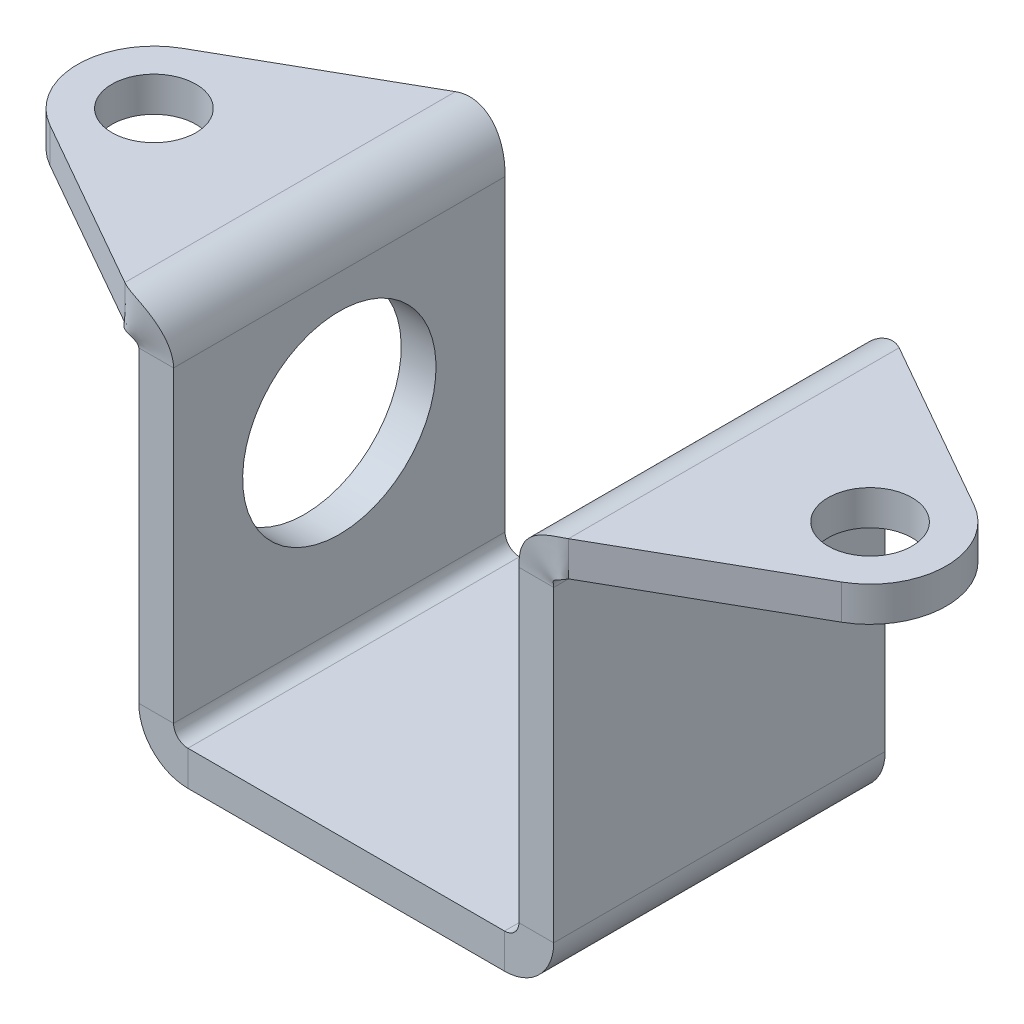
ISO-10303-21;
HEADER;
FILE_DESCRIPTION(('STEP AP214'),'2;1');
FILE_NAME('part.step','',(''),(''),'','','');
FILE_SCHEMA(('AUTOMOTIVE_DESIGN { 1 0 10303 214 1 1 1 1 }'));
ENDSEC;
DATA;
#1=APPLICATION_CONTEXT('core data for automotive mechanical design processes');
#2=APPLICATION_PROTOCOL_DEFINITION('international standard','automotive_design',2000,#1);
#3=PRODUCT_CONTEXT('',#1,'mechanical');
#4=PRODUCT('Part','Part','',(#3));
#5=PRODUCT_RELATED_PRODUCT_CATEGORY('part','',(#4));
#6=PRODUCT_DEFINITION_FORMATION('','',#4);
#7=PRODUCT_DEFINITION_CONTEXT('part definition',#1,'design');
#8=PRODUCT_DEFINITION('design','',#6,#7);
#9=PRODUCT_DEFINITION_SHAPE('','',#8);
#10=(LENGTH_UNIT() NAMED_UNIT(*) SI_UNIT(.MILLI.,.METRE.));
#11=(NAMED_UNIT(*) PLANE_ANGLE_UNIT() SI_UNIT($,.RADIAN.));
#12=(NAMED_UNIT(*) SI_UNIT($,.STERADIAN.) SOLID_ANGLE_UNIT());
#13=UNCERTAINTY_MEASURE_WITH_UNIT(LENGTH_MEASURE(1.E-05),#10,'distance_accuracy_value','');
#14=(GEOMETRIC_REPRESENTATION_CONTEXT(3) GLOBAL_UNCERTAINTY_ASSIGNED_CONTEXT((#13)) GLOBAL_UNIT_ASSIGNED_CONTEXT((#10,
#11,#12)) REPRESENTATION_CONTEXT('',''));
#15=CARTESIAN_POINT('',(0.,0.,0.));
#16=DIRECTION('',(0.,0.,1.));
#17=DIRECTION('',(1.,0.,0.));
#18=AXIS2_PLACEMENT_3D('',#15,#16,#17);
#19=CARTESIAN_POINT('',(-9.92100328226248,-32.4177103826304,9.525));
#20=DIRECTION('',(0.,0.,1.));
#21=DIRECTION('',(0.,1.,0.));
#22=AXIS2_PLACEMENT_3D('',#19,#20,#21);
#23=PLANE('',#22);
#24=CARTESIAN_POINT('',(-11.9210032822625,-35.2427105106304,9.525));
#25=CARTESIAN_POINT('',(-9.92100328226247,-35.2427105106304,9.525));
#26=B_SPLINE_CURVE_WITH_KNOTS('',1,(#24,#25),.UNSPECIFIED.,.F.,.F.,(2,2),(0.,1.),.UNSPECIFIED.);
#27=CARTESIAN_POINT('',(-11.9210032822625,-35.2427105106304,9.525));
#28=VERTEX_POINT('',#27);
#29=CARTESIAN_POINT('',(-9.92100328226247,-35.2427105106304,9.525));
#30=VERTEX_POINT('',#29);
#31=EDGE_CURVE('E13',#28,#30,#26,.T.);
#32=ORIENTED_EDGE('',*,*,#31,.F.);
#33=DIRECTION('',(0.,-1.,0.));
#34=VECTOR('',#33,1.);
#35=CARTESIAN_POINT('',(-11.9210032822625,-32.4177103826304,9.525));
#36=LINE('',#35,#34);
#37=CARTESIAN_POINT('',(-11.9210032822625,-52.9287102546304,9.525));
#38=VERTEX_POINT('',#37);
#39=EDGE_CURVE('E140',#38,#28,#36,.F.);
#40=ORIENTED_EDGE('',*,*,#39,.F.);
#41=DIRECTION('',(1.,0.,0.));
#42=VECTOR('',#41,1.);
#43=CARTESIAN_POINT('',(-9.92100328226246,-52.9287102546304,9.525));
#44=LINE('',#43,#42);
#45=CARTESIAN_POINT('',(-9.92100328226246,-52.9287102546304,9.525));
#46=VERTEX_POINT('',#45);
#47=EDGE_CURVE('E63',#38,#46,#44,.T.);
#48=ORIENTED_EDGE('',*,*,#47,.T.);
#49=DIRECTION('',(0.,1.,0.));
#50=VECTOR('',#49,1.);
#51=CARTESIAN_POINT('',(-9.92100328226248,-32.4177103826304,9.525));
#52=LINE('',#51,#50);
#53=EDGE_CURVE('E142',#46,#30,#52,.T.);
#54=ORIENTED_EDGE('',*,*,#53,.T.);
#55=EDGE_LOOP('',(#32,#40,#48,#54));
#56=FACE_BOUND('',#55,.T.);
#57=ADVANCED_FACE('F51',(#56),#23,.T.);
#58=CARTESIAN_POINT('',(-9.09600315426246,-52.9287102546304,9.525));
#59=DIRECTION('',(0.,0.,1.));
#60=DIRECTION('',(1.,0.,0.));
#61=AXIS2_PLACEMENT_3D('',#58,#59,#60);
#62=PLANE('',#61);
#63=ORIENTED_EDGE('',*,*,#47,.F.);
#64=CARTESIAN_POINT('',(-9.09600315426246,-52.9287102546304,9.525));
#65=DIRECTION('',(0.,0.,1.));
#66=DIRECTION('',(1.,0.,0.));
#67=AXIS2_PLACEMENT_3D('',#64,#65,#66);
#68=CIRCLE('',#67,2.825000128);
#69=CARTESIAN_POINT('',(-9.09600315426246,-55.7537103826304,9.525));
#70=VERTEX_POINT('',#69);
#71=EDGE_CURVE('E610',#38,#70,#68,.T.);
#72=ORIENTED_EDGE('',*,*,#71,.T.);
#73=DIRECTION('',(0.,1.,0.));
#74=VECTOR('',#73,1.);
#75=CARTESIAN_POINT('',(-9.09600315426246,-53.7537103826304,9.525));
#76=LINE('',#75,#74);
#77=CARTESIAN_POINT('',(-9.09600315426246,-53.7537103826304,9.525));
#78=VERTEX_POINT('',#77);
#79=EDGE_CURVE('E227',#70,#78,#76,.T.);
#80=ORIENTED_EDGE('',*,*,#79,.T.);
#81=CARTESIAN_POINT('',(-9.09600315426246,-52.9287102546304,9.525));
#82=DIRECTION('',(0.,0.,-1.));
#83=DIRECTION('',(-1.,0.,0.));
#84=AXIS2_PLACEMENT_3D('',#81,#82,#83);
#85=CIRCLE('',#84,0.825000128);
#86=EDGE_CURVE('E578',#46,#78,#85,.F.);
#87=ORIENTED_EDGE('',*,*,#86,.F.);
#88=EDGE_LOOP('',(#63,#72,#80,#87));
#89=FACE_BOUND('',#88,.T.);
#90=ADVANCED_FACE('F846',(#89),#62,.T.);
#91=CARTESIAN_POINT('',(-9.92100328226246,-53.7537103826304,9.525));
#92=DIRECTION('',(0.,0.,1.));
#93=DIRECTION('',(-1.,0.,0.));
#94=AXIS2_PLACEMENT_3D('',#91,#92,#93);
#95=PLANE('',#94);
#96=ORIENTED_EDGE('',*,*,#79,.F.);
#97=DIRECTION('',(1.,0.,0.));
#98=VECTOR('',#97,1.);
#99=CARTESIAN_POINT('',(-9.92100328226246,-55.7537103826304,9.525));
#100=LINE('',#99,#98);
#101=CARTESIAN_POINT('',(9.09600315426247,-55.7537103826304,9.525));
#102=VERTEX_POINT('',#101);
#103=EDGE_CURVE('E614',#102,#70,#100,.F.);
#104=ORIENTED_EDGE('',*,*,#103,.F.);
#105=DIRECTION('',(0.,1.,0.));
#106=VECTOR('',#105,1.);
#107=CARTESIAN_POINT('',(9.09600315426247,-53.7537103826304,9.525));
#108=LINE('',#107,#106);
#109=CARTESIAN_POINT('',(9.09600315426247,-53.7537103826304,9.525));
#110=VERTEX_POINT('',#109);
#111=EDGE_CURVE('E230',#102,#110,#108,.T.);
#112=ORIENTED_EDGE('',*,*,#111,.T.);
#113=DIRECTION('',(-1.,0.,0.));
#114=VECTOR('',#113,1.);
#115=CARTESIAN_POINT('',(-9.92100328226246,-53.7537103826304,9.525));
#116=LINE('',#115,#114);
#117=EDGE_CURVE('E877',#110,#78,#116,.T.);
#118=ORIENTED_EDGE('',*,*,#117,.T.);
#119=EDGE_LOOP('',(#96,#104,#112,#118));
#120=FACE_BOUND('',#119,.T.);
#121=ADVANCED_FACE('F850',(#120),#95,.T.);
#122=CARTESIAN_POINT('',(9.09600315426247,-52.9287102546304,9.525));
#123=DIRECTION('',(0.,0.,1.));
#124=DIRECTION('',(1.,0.,0.));
#125=AXIS2_PLACEMENT_3D('',#122,#123,#124);
#126=PLANE('',#125);
#127=ORIENTED_EDGE('',*,*,#111,.F.);
#128=CARTESIAN_POINT('',(9.09600315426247,-52.9287102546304,9.525));
#129=DIRECTION('',(0.,0.,1.));
#130=DIRECTION('',(1.,0.,0.));
#131=AXIS2_PLACEMENT_3D('',#128,#129,#130);
#132=CIRCLE('',#131,2.825000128);
#133=CARTESIAN_POINT('',(11.9210032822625,-52.9287102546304,9.525));
#134=VERTEX_POINT('',#133);
#135=EDGE_CURVE('E618',#102,#134,#132,.T.);
#136=ORIENTED_EDGE('',*,*,#135,.T.);
#137=DIRECTION('',(-1.,0.,0.));
#138=VECTOR('',#137,1.);
#139=CARTESIAN_POINT('',(9.92100328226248,-52.9287102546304,9.525));
#140=LINE('',#139,#138);
#141=CARTESIAN_POINT('',(9.92100328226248,-52.9287102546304,9.525));
#142=VERTEX_POINT('',#141);
#143=EDGE_CURVE('E233',#134,#142,#140,.T.);
#144=ORIENTED_EDGE('',*,*,#143,.T.);
#145=CARTESIAN_POINT('',(9.09600315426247,-52.9287102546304,9.525));
#146=DIRECTION('',(0.,0.,-1.));
#147=DIRECTION('',(-1.,0.,0.));
#148=AXIS2_PLACEMENT_3D('',#145,#146,#147);
#149=CIRCLE('',#148,0.825000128);
#150=EDGE_CURVE('E577',#110,#142,#149,.F.);
#151=ORIENTED_EDGE('',*,*,#150,.F.);
#152=EDGE_LOOP('',(#127,#136,#144,#151));
#153=FACE_BOUND('',#152,.T.);
#154=ADVANCED_FACE('F855',(#153),#126,.T.);
#155=CARTESIAN_POINT('',(9.92100328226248,-53.7537103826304,9.525));
#156=DIRECTION('',(0.,0.,1.));
#157=DIRECTION('',(0.,-1.,0.));
#158=AXIS2_PLACEMENT_3D('',#155,#156,#157);
#159=PLANE('',#158);
#160=ORIENTED_EDGE('',*,*,#143,.F.);
#161=DIRECTION('',(0.,1.,0.));
#162=VECTOR('',#161,1.);
#163=CARTESIAN_POINT('',(11.9210032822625,-53.7537103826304,9.525));
#164=LINE('',#163,#162);
#165=CARTESIAN_POINT('',(11.9210032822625,-35.2427105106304,9.525));
#166=VERTEX_POINT('',#165);
#167=EDGE_CURVE('E320',#166,#134,#164,.F.);
#168=ORIENTED_EDGE('',*,*,#167,.F.);
#169=CARTESIAN_POINT('',(9.92100328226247,-35.2427105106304,9.525));
#170=CARTESIAN_POINT('',(11.9210032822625,-35.2427105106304,9.525));
#171=B_SPLINE_CURVE_WITH_KNOTS('',1,(#169,#170),.UNSPECIFIED.,.F.,.F.,(2,2),(0.,1.),.UNSPECIFIED.);
#172=CARTESIAN_POINT('',(9.92100328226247,-35.2427105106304,9.525));
#173=VERTEX_POINT('',#172);
#174=EDGE_CURVE('E236',#166,#173,#171,.F.);
#175=ORIENTED_EDGE('',*,*,#174,.T.);
#176=DIRECTION('',(0.,-1.,0.));
#177=VECTOR('',#176,1.);
#178=CARTESIAN_POINT('',(9.92100328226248,-53.7537103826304,9.525));
#179=LINE('',#178,#177);
#180=EDGE_CURVE('E317',#173,#142,#179,.T.);
#181=ORIENTED_EDGE('',*,*,#180,.T.);
#182=EDGE_LOOP('',(#160,#168,#175,#181));
#183=FACE_BOUND('',#182,.T.);
#184=ADVANCED_FACE('F255',(#183),#159,.T.);
#185=CARTESIAN_POINT('',(12.7460034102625,-32.4177103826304,9.49883295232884));
#186=CARTESIAN_POINT('',(12.4571553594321,-32.4177103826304,9.66313165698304));
#187=CARTESIAN_POINT('',(12.1157526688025,-32.4646648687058,9.74738413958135));
#188=CARTESIAN_POINT('',(11.4281980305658,-32.7172120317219,9.81401939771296));
#189=CARTESIAN_POINT('',(11.0837956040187,-32.9238799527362,9.79671396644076));
#190=CARTESIAN_POINT('',(10.5064802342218,-33.4751002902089,9.7209504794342));
#191=CARTESIAN_POINT('',(10.275923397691,-33.8179725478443,9.66249242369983));
#192=CARTESIAN_POINT('',(9.9832694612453,-34.5366831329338,9.56451718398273));
#193=CARTESIAN_POINT('',(9.92100328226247,-34.9103029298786,9.525));
#194=CARTESIAN_POINT('',(9.92100328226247,-35.2427105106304,9.525));
#195=CARTESIAN_POINT('',(12.7460034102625,-34.4177103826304,9.49883295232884));
#196=CARTESIAN_POINT('',(12.6615336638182,-34.4177103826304,9.66335736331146));
#197=CARTESIAN_POINT('',(12.5619478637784,-34.4314227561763,9.74738413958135));
#198=CARTESIAN_POINT('',(12.3611575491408,-34.5051754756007,9.81401939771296));
#199=CARTESIAN_POINT('',(12.2605798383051,-34.565529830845,9.79671396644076));
#200=CARTESIAN_POINT('',(12.0919832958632,-34.7265056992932,9.7209504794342));
#201=CARTESIAN_POINT('',(12.0246525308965,-34.8266365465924,9.66249242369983));
#202=CARTESIAN_POINT('',(11.9391872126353,-35.0365255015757,9.56451718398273));
#203=CARTESIAN_POINT('',(11.9210032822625,-35.145635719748,9.525));
#204=CARTESIAN_POINT('',(11.9210032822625,-35.2427105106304,9.525));
#205=B_SPLINE_SURFACE_WITH_KNOTS('',1,3,((#185,#186,#187,#188,#189,#190,#191,#192,#193,#194),
(#195,#196,#197,#198,#199,#200,#201,#202,#203,#204)),.UNSPECIFIED.,.F.,.F.,.F.,(2,2),(4,2,2,2,
4),(0.,1.),(0.,0.25,0.5,0.75,1.),.UNSPECIFIED.);
#206=CARTESIAN_POINT('',(11.9210032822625,-35.2427105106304,9.525));
#207=CARTESIAN_POINT('',(11.9210032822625,-35.145635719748,9.525));
#208=CARTESIAN_POINT('',(11.9391872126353,-35.0365255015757,9.56451718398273));
#209=CARTESIAN_POINT('',(12.0246525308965,-34.8266365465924,9.66249242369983));
#210=CARTESIAN_POINT('',(12.0919832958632,-34.7265056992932,9.7209504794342));
#211=CARTESIAN_POINT('',(12.2605798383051,-34.565529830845,9.79671396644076));
#212=CARTESIAN_POINT('',(12.3611575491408,-34.5051754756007,9.81401939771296));
#213=CARTESIAN_POINT('',(12.5619478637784,-34.4314227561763,9.74738413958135));
#214=CARTESIAN_POINT('',(12.6615336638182,-34.4177103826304,9.66335736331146));
#215=CARTESIAN_POINT('',(12.7460034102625,-34.4177103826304,9.49883295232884));
#216=B_SPLINE_CURVE_WITH_KNOTS('',3,(#206,#207,#208,#209,#210,#211,#212,#213,#214,#215),
.UNSPECIFIED.,.F.,.F.,(4,2,2,2,4),(0.,0.25,0.5,0.75,1.),.UNSPECIFIED.);
#217=CARTESIAN_POINT('',(12.7460034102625,-34.4177103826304,9.49883295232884));
#218=VERTEX_POINT('',#217);
#219=EDGE_CURVE('E411',#166,#218,#216,.T.);
#220=CARTESIAN_POINT('',(12.7460034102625,-34.4177103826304,9.49883295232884));
#221=CARTESIAN_POINT('',(12.7460034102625,-32.4177103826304,9.49883295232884));
#222=B_SPLINE_CURVE_WITH_KNOTS('',1,(#220,#221),.UNSPECIFIED.,.F.,.F.,(2,2),(0.,1.),.UNSPECIFIED.);
#223=CARTESIAN_POINT('',(12.7460034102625,-32.4177103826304,9.49883295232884));
#224=VERTEX_POINT('',#223);
#225=EDGE_CURVE('E293',#218,#224,#222,.T.);
#226=CARTESIAN_POINT('',(12.7460034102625,-32.4177103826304,9.49883295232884));
#227=CARTESIAN_POINT('',(12.4571553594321,-32.4177103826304,9.66313165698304));
#228=CARTESIAN_POINT('',(12.1157526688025,-32.4646648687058,9.74738413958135));
#229=CARTESIAN_POINT('',(11.4281980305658,-32.7172120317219,9.81401939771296));
#230=CARTESIAN_POINT('',(11.0837956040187,-32.9238799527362,9.79671396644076));
#231=CARTESIAN_POINT('',(10.5064802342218,-33.4751002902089,9.7209504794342));
#232=CARTESIAN_POINT('',(10.275923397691,-33.8179725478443,9.66249242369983));
#233=CARTESIAN_POINT('',(9.9832694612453,-34.5366831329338,9.56451718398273));
#234=CARTESIAN_POINT('',(9.92100328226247,-34.9103029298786,9.525));
#235=CARTESIAN_POINT('',(9.92100328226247,-35.2427105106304,9.525));
#236=B_SPLINE_CURVE_WITH_KNOTS('',3,(#226,#227,#228,#229,#230,#231,#232,#233,#234,#235),
.UNSPECIFIED.,.F.,.F.,(4,2,2,2,4),(0.,0.25,0.5,0.75,1.),.UNSPECIFIED.);
#237=EDGE_CURVE('E339',#173,#224,#236,.F.);
#238=ORIENTED_EDGE('',*,*,#174,.F.);
#239=ORIENTED_EDGE('',*,*,#219,.T.);
#240=ORIENTED_EDGE('',*,*,#225,.T.);
#241=ORIENTED_EDGE('',*,*,#237,.F.);
#242=EDGE_LOOP('',(#238,#239,#240,#241));
#243=FACE_BOUND('',#242,.T.);
#244=ADVANCED_FACE('F242',(#243),#205,.F.);
#245=CARTESIAN_POINT('',(12.7,-32.4177103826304,9.525));
#246=DIRECTION('',(0.494419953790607,0.,0.86922316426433));
#247=DIRECTION('',(-0.86922316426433,0.,0.494419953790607));
#248=AXIS2_PLACEMENT_3D('',#245,#246,#247);
#249=PLANE('',#248);
#250=ORIENTED_EDGE('',*,*,#225,.F.);
#251=DIRECTION('',(-0.86922316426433,0.,0.494419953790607));
#252=VECTOR('',#251,1.);
#253=CARTESIAN_POINT('',(12.7,-34.4177103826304,9.525));
#254=LINE('',#253,#252);
#255=CARTESIAN_POINT('',(22.7426682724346,-34.4177103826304,3.81266306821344));
#256=VERTEX_POINT('',#255);
#257=EDGE_CURVE('E548',#256,#218,#254,.T.);
#258=ORIENTED_EDGE('',*,*,#257,.F.);
#259=DIRECTION('',(0.,1.,0.));
#260=VECTOR('',#259,1.);
#261=CARTESIAN_POINT('',(22.7426682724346,-32.4177103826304,3.81266306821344));
#262=LINE('',#261,#260);
#263=CARTESIAN_POINT('',(22.7426682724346,-32.4177103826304,3.81266306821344));
#264=VERTEX_POINT('',#263);
#265=EDGE_CURVE('E544',#256,#264,#262,.T.);
#266=ORIENTED_EDGE('',*,*,#265,.T.);
#267=DIRECTION('',(-0.86922316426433,0.,0.494419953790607));
#268=VECTOR('',#267,1.);
#269=CARTESIAN_POINT('',(12.7,-32.4177103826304,9.525));
#270=LINE('',#269,#268);
#271=EDGE_CURVE('E396',#264,#224,#270,.T.);
#272=ORIENTED_EDGE('',*,*,#271,.T.);
#273=EDGE_LOOP('',(#250,#258,#266,#272));
#274=FACE_BOUND('',#273,.T.);
#275=ADVANCED_FACE('F254',(#274),#249,.T.);
#276=CARTESIAN_POINT('',(20.574,-32.4177103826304,0.));
#277=DIRECTION('',(0.,-1.,0.));
#278=DIRECTION('',(0.,0.,-1.));
#279=AXIS2_PLACEMENT_3D('',#276,#277,#278);
#280=CYLINDRICAL_SURFACE('',#279,4.38628792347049);
#281=ORIENTED_EDGE('',*,*,#265,.F.);
#282=CARTESIAN_POINT('',(20.574,-34.4177103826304,0.));
#283=DIRECTION('',(0.,-1.,0.));
#284=DIRECTION('',(0.,0.,-1.));
#285=AXIS2_PLACEMENT_3D('',#282,#283,#284);
#286=CIRCLE('',#285,4.38628792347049);
#287=CARTESIAN_POINT('',(22.7426682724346,-34.4177103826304,-3.81266306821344));
#288=VERTEX_POINT('',#287);
#289=EDGE_CURVE('E454',#288,#256,#286,.T.);
#290=ORIENTED_EDGE('',*,*,#289,.F.);
#291=DIRECTION('',(0.,1.,0.));
#292=VECTOR('',#291,1.);
#293=CARTESIAN_POINT('',(22.7426682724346,-32.4177103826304,-3.81266306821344));
#294=LINE('',#293,#292);
#295=CARTESIAN_POINT('',(22.7426682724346,-32.4177103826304,-3.81266306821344));
#296=VERTEX_POINT('',#295);
#297=EDGE_CURVE('E537',#288,#296,#294,.T.);
#298=ORIENTED_EDGE('',*,*,#297,.T.);
#299=CARTESIAN_POINT('',(20.574,-32.4177103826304,0.));
#300=DIRECTION('',(0.,-1.,0.));
#301=DIRECTION('',(0.,0.,-1.));
#302=AXIS2_PLACEMENT_3D('',#299,#300,#301);
#303=CIRCLE('',#302,4.38628792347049);
#304=EDGE_CURVE('E558',#296,#264,#303,.T.);
#305=ORIENTED_EDGE('',*,*,#304,.T.);
#306=EDGE_LOOP('',(#281,#290,#298,#305));
#307=FACE_BOUND('',#306,.T.);
#308=ADVANCED_FACE('F559',(#307),#280,.T.);
#309=CARTESIAN_POINT('',(12.7,-32.4177103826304,-9.525));
#310=DIRECTION('',(0.494419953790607,0.,-0.86922316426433));
#311=DIRECTION('',(0.86922316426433,0.,0.494419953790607));
#312=AXIS2_PLACEMENT_3D('',#309,#310,#311);
#313=PLANE('',#312);
#314=ORIENTED_EDGE('',*,*,#297,.F.);
#315=DIRECTION('',(0.86922316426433,0.,0.494419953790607));
#316=VECTOR('',#315,1.);
#317=CARTESIAN_POINT('',(12.7,-34.4177103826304,-9.525));
#318=LINE('',#317,#316);
#319=CARTESIAN_POINT('',(12.7460034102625,-34.4177103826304,-9.49883295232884));
#320=VERTEX_POINT('',#319);
#321=EDGE_CURVE('E450',#320,#288,#318,.T.);
#322=ORIENTED_EDGE('',*,*,#321,.F.);
#323=CARTESIAN_POINT('',(12.7460034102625,-32.4177103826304,-9.49883295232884));
#324=CARTESIAN_POINT('',(12.7460034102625,-34.4177103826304,-9.49883295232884));
#325=B_SPLINE_CURVE_WITH_KNOTS('',1,(#323,#324),.UNSPECIFIED.,.F.,.F.,(2,2),(0.,1.),.UNSPECIFIED.);
#326=CARTESIAN_POINT('',(12.7460034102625,-32.4177103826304,-9.49883295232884));
#327=VERTEX_POINT('',#326);
#328=EDGE_CURVE('E523',#320,#327,#325,.F.);
#329=ORIENTED_EDGE('',*,*,#328,.T.);
#330=DIRECTION('',(0.86922316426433,0.,0.494419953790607));
#331=VECTOR('',#330,1.);
#332=CARTESIAN_POINT('',(12.7,-32.4177103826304,-9.525));
#333=LINE('',#332,#331);
#334=EDGE_CURVE('E367',#327,#296,#333,.T.);
#335=ORIENTED_EDGE('',*,*,#334,.T.);
#336=EDGE_LOOP('',(#314,#322,#329,#335));
#337=FACE_BOUND('',#336,.T.);
#338=ADVANCED_FACE('F480',(#337),#313,.T.);
#339=CARTESIAN_POINT('',(9.92100328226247,-35.2427105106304,-9.525));
#340=CARTESIAN_POINT('',(9.92100328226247,-34.9103029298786,-9.525));
#341=CARTESIAN_POINT('',(9.9832694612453,-34.5366831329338,-9.56451718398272));
#342=CARTESIAN_POINT('',(10.275923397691,-33.8179725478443,-9.66249242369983));
#343=CARTESIAN_POINT('',(10.5064802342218,-33.4751002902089,-9.7209504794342));
#344=CARTESIAN_POINT('',(11.0837956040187,-32.9238799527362,-9.79671396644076));
#345=CARTESIAN_POINT('',(11.4281980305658,-32.7172120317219,-9.81401939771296));
#346=CARTESIAN_POINT('',(12.1157526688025,-32.4646648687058,-9.74738413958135));
#347=CARTESIAN_POINT('',(12.4571553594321,-32.4177103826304,-9.66313165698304));
#348=CARTESIAN_POINT('',(12.7460034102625,-32.4177103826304,-9.49883295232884));
#349=CARTESIAN_POINT('',(11.9210032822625,-35.2427105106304,-9.525));
#350=CARTESIAN_POINT('',(11.9210032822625,-35.145635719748,-9.525));
#351=CARTESIAN_POINT('',(11.9391872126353,-35.0365255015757,-9.56451718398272));
#352=CARTESIAN_POINT('',(12.0246525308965,-34.8266365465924,-9.66249242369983));
#353=CARTESIAN_POINT('',(12.0919832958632,-34.7265056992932,-9.7209504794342));
#354=CARTESIAN_POINT('',(12.2605798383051,-34.565529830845,-9.79671396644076));
#355=CARTESIAN_POINT('',(12.3611575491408,-34.5051754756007,-9.81401939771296));
#356=CARTESIAN_POINT('',(12.5619478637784,-34.4314227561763,-9.74738413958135));
#357=CARTESIAN_POINT('',(12.6615336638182,-34.4177103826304,-9.66335736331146));
#358=CARTESIAN_POINT('',(12.7460034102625,-34.4177103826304,-9.49883295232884));
#359=B_SPLINE_SURFACE_WITH_KNOTS('',1,3,((#339,#340,#341,#342,#343,#344,#345,#346,#347,#348),
(#349,#350,#351,#352,#353,#354,#355,#356,#357,#358)),.UNSPECIFIED.,.F.,.F.,.F.,(2,2),(4,2,2,2,
4),(0.,1.),(0.,0.25,0.5,0.75,1.),.UNSPECIFIED.);
#360=CARTESIAN_POINT('',(12.7460034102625,-34.4177103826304,-9.49883295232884));
#361=CARTESIAN_POINT('',(12.6615336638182,-34.4177103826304,-9.66335736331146));
#362=CARTESIAN_POINT('',(12.5619478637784,-34.4314227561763,-9.74738413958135));
#363=CARTESIAN_POINT('',(12.3611575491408,-34.5051754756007,-9.81401939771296));
#364=CARTESIAN_POINT('',(12.2605798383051,-34.565529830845,-9.79671396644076));
#365=CARTESIAN_POINT('',(12.0919832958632,-34.7265056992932,-9.7209504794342));
#366=CARTESIAN_POINT('',(12.0246525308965,-34.8266365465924,-9.66249242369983));
#367=CARTESIAN_POINT('',(11.9391872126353,-35.0365255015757,-9.56451718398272));
#368=CARTESIAN_POINT('',(11.9210032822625,-35.145635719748,-9.525));
#369=CARTESIAN_POINT('',(11.9210032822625,-35.2427105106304,-9.525));
#370=B_SPLINE_CURVE_WITH_KNOTS('',3,(#360,#361,#362,#363,#364,#365,#366,#367,#368,#369),
.UNSPECIFIED.,.F.,.F.,(4,2,2,2,4),(0.,0.25,0.5,0.75,1.),.UNSPECIFIED.);
#371=CARTESIAN_POINT('',(11.9210032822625,-35.2427105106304,-9.525));
#372=VERTEX_POINT('',#371);
#373=EDGE_CURVE('E622',#320,#372,#370,.T.);
#374=CARTESIAN_POINT('',(11.9210032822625,-35.2427105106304,-9.525));
#375=CARTESIAN_POINT('',(9.92100328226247,-35.2427105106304,-9.525));
#376=B_SPLINE_CURVE_WITH_KNOTS('',1,(#374,#375),.UNSPECIFIED.,.F.,.F.,(2,2),(0.,1.),.UNSPECIFIED.);
#377=CARTESIAN_POINT('',(9.92100328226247,-35.2427105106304,-9.525));
#378=VERTEX_POINT('',#377);
#379=EDGE_CURVE('E509',#372,#378,#376,.T.);
#380=CARTESIAN_POINT('',(9.92100328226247,-35.2427105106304,-9.525));
#381=CARTESIAN_POINT('',(9.92100328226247,-34.9103029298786,-9.525));
#382=CARTESIAN_POINT('',(9.9832694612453,-34.5366831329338,-9.56451718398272));
#383=CARTESIAN_POINT('',(10.275923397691,-33.8179725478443,-9.66249242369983));
#384=CARTESIAN_POINT('',(10.5064802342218,-33.4751002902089,-9.7209504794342));
#385=CARTESIAN_POINT('',(11.0837956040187,-32.9238799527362,-9.79671396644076));
#386=CARTESIAN_POINT('',(11.4281980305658,-32.7172120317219,-9.81401939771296));
#387=CARTESIAN_POINT('',(12.1157526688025,-32.4646648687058,-9.74738413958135));
#388=CARTESIAN_POINT('',(12.4571553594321,-32.4177103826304,-9.66313165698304));
#389=CARTESIAN_POINT('',(12.7460034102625,-32.4177103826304,-9.49883295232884));
#390=B_SPLINE_CURVE_WITH_KNOTS('',3,(#380,#381,#382,#383,#384,#385,#386,#387,#388,#389),
.UNSPECIFIED.,.F.,.F.,(4,2,2,2,4),(0.,0.25,0.5,0.75,1.),.UNSPECIFIED.);
#391=EDGE_CURVE('E344',#327,#378,#390,.F.);
#392=ORIENTED_EDGE('',*,*,#328,.F.);
#393=ORIENTED_EDGE('',*,*,#373,.T.);
#394=ORIENTED_EDGE('',*,*,#379,.T.);
#395=ORIENTED_EDGE('',*,*,#391,.F.);
#396=EDGE_LOOP('',(#392,#393,#394,#395));
#397=FACE_BOUND('',#396,.T.);
#398=ADVANCED_FACE('F467',(#397),#359,.F.);
#399=CARTESIAN_POINT('',(9.92100328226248,-53.7537103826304,-9.525));
#400=DIRECTION('',(0.,0.,1.));
#401=DIRECTION('',(0.,-1.,0.));
#402=AXIS2_PLACEMENT_3D('',#399,#400,#401);
#403=PLANE('',#402);
#404=ORIENTED_EDGE('',*,*,#379,.F.);
#405=DIRECTION('',(0.,1.,0.));
#406=VECTOR('',#405,1.);
#407=CARTESIAN_POINT('',(11.9210032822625,-53.7537103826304,-9.52499999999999));
#408=LINE('',#407,#406);
#409=CARTESIAN_POINT('',(11.9210032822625,-52.9287102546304,-9.52499999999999));
#410=VERTEX_POINT('',#409);
#411=EDGE_CURVE('E625',#372,#410,#408,.F.);
#412=ORIENTED_EDGE('',*,*,#411,.T.);
#413=DIRECTION('',(-1.,0.,0.));
#414=VECTOR('',#413,1.);
#415=CARTESIAN_POINT('',(9.92100328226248,-52.9287102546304,-9.525));
#416=LINE('',#415,#414);
#417=CARTESIAN_POINT('',(9.92100328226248,-52.9287102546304,-9.525));
#418=VERTEX_POINT('',#417);
#419=EDGE_CURVE('E806',#410,#418,#416,.T.);
#420=ORIENTED_EDGE('',*,*,#419,.T.);
#421=DIRECTION('',(0.,-1.,0.));
#422=VECTOR('',#421,1.);
#423=CARTESIAN_POINT('',(9.92100328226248,-53.7537103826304,-9.525));
#424=LINE('',#423,#422);
#425=EDGE_CURVE('E336',#378,#418,#424,.T.);
#426=ORIENTED_EDGE('',*,*,#425,.F.);
#427=EDGE_LOOP('',(#404,#412,#420,#426));
#428=FACE_BOUND('',#427,.T.);
#429=ADVANCED_FACE('F479',(#428),#403,.F.);
#430=CARTESIAN_POINT('',(9.09600315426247,-52.9287102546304,-9.525));
#431=DIRECTION('',(0.,0.,-1.));
#432=DIRECTION('',(-1.,0.,0.));
#433=AXIS2_PLACEMENT_3D('',#430,#431,#432);
#434=PLANE('',#433);
#435=ORIENTED_EDGE('',*,*,#419,.F.);
#436=CARTESIAN_POINT('',(9.09600315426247,-52.9287102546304,-9.525));
#437=DIRECTION('',(0.,0.,1.));
#438=DIRECTION('',(1.,0.,0.));
#439=AXIS2_PLACEMENT_3D('',#436,#437,#438);
#440=CIRCLE('',#439,2.825000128);
#441=CARTESIAN_POINT('',(9.09600315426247,-55.7537103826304,-9.525));
#442=VERTEX_POINT('',#441);
#443=EDGE_CURVE('E615',#410,#442,#440,.F.);
#444=ORIENTED_EDGE('',*,*,#443,.T.);
#445=DIRECTION('',(0.,1.,0.));
#446=VECTOR('',#445,1.);
#447=CARTESIAN_POINT('',(9.09600315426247,-53.7537103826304,-9.525));
#448=LINE('',#447,#446);
#449=CARTESIAN_POINT('',(9.09600315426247,-53.7537103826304,-9.525));
#450=VERTEX_POINT('',#449);
#451=EDGE_CURVE('E804',#442,#450,#448,.T.);
#452=ORIENTED_EDGE('',*,*,#451,.T.);
#453=CARTESIAN_POINT('',(9.09600315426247,-52.9287102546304,-9.525));
#454=DIRECTION('',(0.,0.,1.));
#455=DIRECTION('',(1.,0.,0.));
#456=AXIS2_PLACEMENT_3D('',#453,#454,#455);
#457=CIRCLE('',#456,0.825000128);
#458=EDGE_CURVE('E574',#418,#450,#457,.F.);
#459=ORIENTED_EDGE('',*,*,#458,.F.);
#460=EDGE_LOOP('',(#435,#444,#452,#459));
#461=FACE_BOUND('',#460,.T.);
#462=ADVANCED_FACE('F890',(#461),#434,.T.);
#463=CARTESIAN_POINT('',(-9.92100328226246,-53.7537103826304,-9.525));
#464=DIRECTION('',(0.,0.,1.));
#465=DIRECTION('',(-1.,0.,0.));
#466=AXIS2_PLACEMENT_3D('',#463,#464,#465);
#467=PLANE('',#466);
#468=ORIENTED_EDGE('',*,*,#451,.F.);
#469=DIRECTION('',(1.,0.,0.));
#470=VECTOR('',#469,1.);
#471=CARTESIAN_POINT('',(-9.92100328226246,-55.7537103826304,-9.525));
#472=LINE('',#471,#470);
#473=CARTESIAN_POINT('',(-9.09600315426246,-55.7537103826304,-9.525));
#474=VERTEX_POINT('',#473);
#475=EDGE_CURVE('E611',#442,#474,#472,.F.);
#476=ORIENTED_EDGE('',*,*,#475,.T.);
#477=DIRECTION('',(0.,1.,0.));
#478=VECTOR('',#477,1.);
#479=CARTESIAN_POINT('',(-9.09600315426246,-53.7537103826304,-9.525));
#480=LINE('',#479,#478);
#481=CARTESIAN_POINT('',(-9.09600315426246,-53.7537103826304,-9.525));
#482=VERTEX_POINT('',#481);
#483=EDGE_CURVE('E801',#474,#482,#480,.T.);
#484=ORIENTED_EDGE('',*,*,#483,.T.);
#485=DIRECTION('',(-1.,0.,0.));
#486=VECTOR('',#485,1.);
#487=CARTESIAN_POINT('',(-9.92100328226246,-53.7537103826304,-9.525));
#488=LINE('',#487,#486);
#489=EDGE_CURVE('E887',#450,#482,#488,.T.);
#490=ORIENTED_EDGE('',*,*,#489,.F.);
#491=EDGE_LOOP('',(#468,#476,#484,#490));
#492=FACE_BOUND('',#491,.T.);
#493=ADVANCED_FACE('F884',(#492),#467,.F.);
#494=CARTESIAN_POINT('',(-9.09600315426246,-52.9287102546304,-9.525));
#495=DIRECTION('',(0.,0.,-1.));
#496=DIRECTION('',(-1.,0.,0.));
#497=AXIS2_PLACEMENT_3D('',#494,#495,#496);
#498=PLANE('',#497);
#499=ORIENTED_EDGE('',*,*,#483,.F.);
#500=CARTESIAN_POINT('',(-9.09600315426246,-52.9287102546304,-9.525));
#501=DIRECTION('',(0.,0.,1.));
#502=DIRECTION('',(1.,0.,0.));
#503=AXIS2_PLACEMENT_3D('',#500,#501,#502);
#504=CIRCLE('',#503,2.825000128);
#505=CARTESIAN_POINT('',(-11.9210032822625,-52.9287102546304,-9.525));
#506=VERTEX_POINT('',#505);
#507=EDGE_CURVE('E184',#474,#506,#504,.F.);
#508=ORIENTED_EDGE('',*,*,#507,.T.);
#509=DIRECTION('',(1.,0.,0.));
#510=VECTOR('',#509,1.);
#511=CARTESIAN_POINT('',(-9.92100328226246,-52.9287102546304,-9.525));
#512=LINE('',#511,#510);
#513=CARTESIAN_POINT('',(-9.92100328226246,-52.9287102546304,-9.525));
#514=VERTEX_POINT('',#513);
#515=EDGE_CURVE('E793',#506,#514,#512,.T.);
#516=ORIENTED_EDGE('',*,*,#515,.T.);
#517=CARTESIAN_POINT('',(-9.09600315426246,-52.9287102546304,-9.525));
#518=DIRECTION('',(0.,0.,1.));
#519=DIRECTION('',(1.,0.,0.));
#520=AXIS2_PLACEMENT_3D('',#517,#518,#519);
#521=CIRCLE('',#520,0.825000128);
#522=EDGE_CURVE('E587',#482,#514,#521,.F.);
#523=ORIENTED_EDGE('',*,*,#522,.F.);
#524=EDGE_LOOP('',(#499,#508,#516,#523));
#525=FACE_BOUND('',#524,.T.);
#526=ADVANCED_FACE('F1168',(#525),#498,.T.);
#527=CARTESIAN_POINT('',(-9.92100328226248,-32.4177103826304,-9.525));
#528=DIRECTION('',(0.,0.,1.));
#529=DIRECTION('',(0.,1.,0.));
#530=AXIS2_PLACEMENT_3D('',#527,#528,#529);
#531=PLANE('',#530);
#532=ORIENTED_EDGE('',*,*,#515,.F.);
#533=DIRECTION('',(0.,-1.,0.));
#534=VECTOR('',#533,1.);
#535=CARTESIAN_POINT('',(-11.9210032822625,-32.4177103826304,-9.52499999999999));
#536=LINE('',#535,#534);
#537=CARTESIAN_POINT('',(-11.9210032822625,-35.2427105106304,-9.52499999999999));
#538=VERTEX_POINT('',#537);
#539=EDGE_CURVE('E176',#506,#538,#536,.F.);
#540=ORIENTED_EDGE('',*,*,#539,.T.);
#541=CARTESIAN_POINT('',(-9.92100328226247,-35.2427105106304,-9.525));
#542=CARTESIAN_POINT('',(-11.9210032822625,-35.2427105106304,-9.525));
#543=B_SPLINE_CURVE_WITH_KNOTS('',1,(#541,#542),.UNSPECIFIED.,.F.,.F.,(2,2),(0.,1.),.UNSPECIFIED.);
#544=CARTESIAN_POINT('',(-9.92100328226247,-35.2427105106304,-9.525));
#545=VERTEX_POINT('',#544);
#546=EDGE_CURVE('E71',#538,#545,#543,.F.);
#547=ORIENTED_EDGE('',*,*,#546,.T.);
#548=DIRECTION('',(0.,1.,0.));
#549=VECTOR('',#548,1.);
#550=CARTESIAN_POINT('',(-9.92100328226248,-32.4177103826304,-9.525));
#551=LINE('',#550,#549);
#552=EDGE_CURVE('E343',#514,#545,#551,.T.);
#553=ORIENTED_EDGE('',*,*,#552,.F.);
#554=EDGE_LOOP('',(#532,#540,#547,#553));
#555=FACE_BOUND('',#554,.T.);
#556=ADVANCED_FACE('F743',(#555),#531,.F.);
#557=CARTESIAN_POINT('',(-12.7460034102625,-32.4177103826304,-9.49883295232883));
#558=CARTESIAN_POINT('',(-12.4571553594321,-32.4177103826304,-9.66313165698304));
#559=CARTESIAN_POINT('',(-12.1157526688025,-32.4646648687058,-9.74738413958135));
#560=CARTESIAN_POINT('',(-11.4281980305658,-32.7172120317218,-9.81401939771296));
#561=CARTESIAN_POINT('',(-11.0837956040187,-32.9238799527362,-9.79671396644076));
#562=CARTESIAN_POINT('',(-10.5064802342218,-33.4751002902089,-9.7209504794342));
#563=CARTESIAN_POINT('',(-10.275923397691,-33.8179725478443,-9.66249242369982));
#564=CARTESIAN_POINT('',(-9.9832694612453,-34.5366831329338,-9.56451718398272));
#565=CARTESIAN_POINT('',(-9.92100328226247,-34.9103029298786,-9.525));
#566=CARTESIAN_POINT('',(-9.92100328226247,-35.2427105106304,-9.525));
#567=CARTESIAN_POINT('',(-12.7460034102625,-34.4177103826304,-9.49883295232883));
#568=CARTESIAN_POINT('',(-12.6615336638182,-34.4177103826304,-9.66335736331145));
#569=CARTESIAN_POINT('',(-12.5619478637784,-34.4314227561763,-9.74738413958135));
#570=CARTESIAN_POINT('',(-12.3611575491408,-34.5051754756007,-9.81401939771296));
#571=CARTESIAN_POINT('',(-12.2605798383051,-34.565529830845,-9.79671396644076));
#572=CARTESIAN_POINT('',(-12.0919832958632,-34.7265056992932,-9.7209504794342));
#573=CARTESIAN_POINT('',(-12.0246525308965,-34.8266365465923,-9.66249242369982));
#574=CARTESIAN_POINT('',(-11.9391872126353,-35.0365255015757,-9.56451718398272));
#575=CARTESIAN_POINT('',(-11.9210032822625,-35.145635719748,-9.525));
#576=CARTESIAN_POINT('',(-11.9210032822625,-35.2427105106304,-9.525));
#577=B_SPLINE_SURFACE_WITH_KNOTS('',1,3,((#557,#558,#559,#560,#561,#562,#563,#564,#565,#566),
(#567,#568,#569,#570,#571,#572,#573,#574,#575,#576)),.UNSPECIFIED.,.F.,.F.,.F.,(2,2),(4,2,2,2,
4),(0.,1.),(0.,0.25,0.5,0.75,1.),.UNSPECIFIED.);
#578=CARTESIAN_POINT('',(-11.9210032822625,-35.2427105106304,-9.525));
#579=CARTESIAN_POINT('',(-11.9210032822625,-35.145635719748,-9.525));
#580=CARTESIAN_POINT('',(-11.9391872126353,-35.0365255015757,-9.56451718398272));
#581=CARTESIAN_POINT('',(-12.0246525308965,-34.8266365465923,-9.66249242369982));
#582=CARTESIAN_POINT('',(-12.0919832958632,-34.7265056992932,-9.7209504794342));
#583=CARTESIAN_POINT('',(-12.2605798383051,-34.565529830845,-9.79671396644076));
#584=CARTESIAN_POINT('',(-12.3611575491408,-34.5051754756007,-9.81401939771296));
#585=CARTESIAN_POINT('',(-12.5619478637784,-34.4314227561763,-9.74738413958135));
#586=CARTESIAN_POINT('',(-12.6615336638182,-34.4177103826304,-9.66335736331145));
#587=CARTESIAN_POINT('',(-12.7460034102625,-34.4177103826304,-9.49883295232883));
#588=B_SPLINE_CURVE_WITH_KNOTS('',3,(#578,#579,#580,#581,#582,#583,#584,#585,#586,#587),
.UNSPECIFIED.,.F.,.F.,(4,2,2,2,4),(0.,0.25,0.5,0.75,1.),.UNSPECIFIED.);
#589=CARTESIAN_POINT('',(-12.7460034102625,-34.4177103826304,-9.49883295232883));
#590=VERTEX_POINT('',#589);
#591=EDGE_CURVE('E162',#538,#590,#588,.T.);
#592=CARTESIAN_POINT('',(-12.7460034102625,-34.4177103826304,-9.49883295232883));
#593=CARTESIAN_POINT('',(-12.7460034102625,-32.4177103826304,-9.49883295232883));
#594=B_SPLINE_CURVE_WITH_KNOTS('',1,(#592,#593),.UNSPECIFIED.,.F.,.F.,(2,2),(0.,1.),.UNSPECIFIED.);
#595=CARTESIAN_POINT('',(-12.7460034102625,-32.4177103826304,-9.49883295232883));
#596=VERTEX_POINT('',#595);
#597=EDGE_CURVE('E773',#590,#596,#594,.T.);
#598=CARTESIAN_POINT('',(-12.7460034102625,-32.4177103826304,-9.49883295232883));
#599=CARTESIAN_POINT('',(-12.4571553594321,-32.4177103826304,-9.66313165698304));
#600=CARTESIAN_POINT('',(-12.1157526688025,-32.4646648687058,-9.74738413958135));
#601=CARTESIAN_POINT('',(-11.4281980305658,-32.7172120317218,-9.81401939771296));
#602=CARTESIAN_POINT('',(-11.0837956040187,-32.9238799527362,-9.79671396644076));
#603=CARTESIAN_POINT('',(-10.5064802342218,-33.4751002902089,-9.7209504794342));
#604=CARTESIAN_POINT('',(-10.275923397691,-33.8179725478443,-9.66249242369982));
#605=CARTESIAN_POINT('',(-9.9832694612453,-34.5366831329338,-9.56451718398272));
#606=CARTESIAN_POINT('',(-9.92100328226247,-34.9103029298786,-9.525));
#607=CARTESIAN_POINT('',(-9.92100328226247,-35.2427105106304,-9.525));
#608=B_SPLINE_CURVE_WITH_KNOTS('',3,(#598,#599,#600,#601,#602,#603,#604,#605,#606,#607),
.UNSPECIFIED.,.F.,.F.,(4,2,2,2,4),(0.,0.25,0.5,0.75,1.),.UNSPECIFIED.);
#609=EDGE_CURVE('E166',#545,#596,#608,.F.);
#610=ORIENTED_EDGE('',*,*,#546,.F.);
#611=ORIENTED_EDGE('',*,*,#591,.T.);
#612=ORIENTED_EDGE('',*,*,#597,.T.);
#613=ORIENTED_EDGE('',*,*,#609,.F.);
#614=EDGE_LOOP('',(#610,#611,#612,#613));
#615=FACE_BOUND('',#614,.T.);
#616=ADVANCED_FACE('F730',(#615),#577,.F.);
#617=CARTESIAN_POINT('',(-12.7,-32.4177103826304,-9.525));
#618=DIRECTION('',(-0.494419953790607,0.,-0.86922316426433));
#619=DIRECTION('',(0.86922316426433,0.,-0.494419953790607));
#620=AXIS2_PLACEMENT_3D('',#617,#618,#619);
#621=PLANE('',#620);
#622=ORIENTED_EDGE('',*,*,#597,.F.);
#623=DIRECTION('',(0.86922316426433,0.,-0.494419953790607));
#624=VECTOR('',#623,1.);
#625=CARTESIAN_POINT('',(-12.7,-34.4177103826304,-9.525));
#626=LINE('',#625,#624);
#627=CARTESIAN_POINT('',(-22.7426682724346,-34.4177103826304,-3.81266306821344));
#628=VERTEX_POINT('',#627);
#629=EDGE_CURVE('E636',#628,#590,#626,.T.);
#630=ORIENTED_EDGE('',*,*,#629,.F.);
#631=DIRECTION('',(0.,1.,0.));
#632=VECTOR('',#631,1.);
#633=CARTESIAN_POINT('',(-22.7426682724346,-32.4177103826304,-3.81266306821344));
#634=LINE('',#633,#632);
#635=CARTESIAN_POINT('',(-22.7426682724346,-32.4177103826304,-3.81266306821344));
#636=VERTEX_POINT('',#635);
#637=EDGE_CURVE('E830',#628,#636,#634,.T.);
#638=ORIENTED_EDGE('',*,*,#637,.T.);
#639=DIRECTION('',(0.86922316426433,0.,-0.494419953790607));
#640=VECTOR('',#639,1.);
#641=CARTESIAN_POINT('',(-12.7,-32.4177103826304,-9.525));
#642=LINE('',#641,#640);
#643=EDGE_CURVE('E352',#636,#596,#642,.T.);
#644=ORIENTED_EDGE('',*,*,#643,.T.);
#645=EDGE_LOOP('',(#622,#630,#638,#644));
#646=FACE_BOUND('',#645,.T.);
#647=ADVANCED_FACE('F742',(#646),#621,.T.);
#648=CARTESIAN_POINT('',(-20.574,-32.4177103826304,0.));
#649=DIRECTION('',(0.,-1.,0.));
#650=DIRECTION('',(0.,0.,-1.));
#651=AXIS2_PLACEMENT_3D('',#648,#649,#650);
#652=CYLINDRICAL_SURFACE('',#651,4.38628792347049);
#653=ORIENTED_EDGE('',*,*,#637,.F.);
#654=CARTESIAN_POINT('',(-20.574,-34.4177103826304,0.));
#655=DIRECTION('',(0.,-1.,0.));
#656=DIRECTION('',(0.,0.,-1.));
#657=AXIS2_PLACEMENT_3D('',#654,#655,#656);
#658=CIRCLE('',#657,4.38628792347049);
#659=CARTESIAN_POINT('',(-22.7426682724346,-34.4177103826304,3.81266306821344));
#660=VERTEX_POINT('',#659);
#661=EDGE_CURVE('E604',#660,#628,#658,.T.);
#662=ORIENTED_EDGE('',*,*,#661,.F.);
#663=DIRECTION('',(0.,1.,0.));
#664=VECTOR('',#663,1.);
#665=CARTESIAN_POINT('',(-22.7426682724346,-32.4177103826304,3.81266306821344));
#666=LINE('',#665,#664);
#667=CARTESIAN_POINT('',(-22.7426682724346,-32.4177103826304,3.81266306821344));
#668=VERTEX_POINT('',#667);
#669=EDGE_CURVE('E193',#660,#668,#666,.T.);
#670=ORIENTED_EDGE('',*,*,#669,.T.);
#671=CARTESIAN_POINT('',(-20.574,-32.4177103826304,0.));
#672=DIRECTION('',(0.,-1.,0.));
#673=DIRECTION('',(0.,0.,1.));
#674=AXIS2_PLACEMENT_3D('',#671,#672,#673);
#675=CIRCLE('',#674,4.38628792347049);
#676=EDGE_CURVE('E567',#668,#636,#675,.T.);
#677=ORIENTED_EDGE('',*,*,#676,.T.);
#678=EDGE_LOOP('',(#653,#662,#670,#677));
#679=FACE_BOUND('',#678,.T.);
#680=ADVANCED_FACE('F839',(#679),#652,.T.);
#681=CARTESIAN_POINT('',(-12.7,-32.4177103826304,9.525));
#682=DIRECTION('',(-0.494419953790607,0.,0.86922316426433));
#683=DIRECTION('',(-0.86922316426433,0.,-0.494419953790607));
#684=AXIS2_PLACEMENT_3D('',#681,#682,#683);
#685=PLANE('',#684);
#686=ORIENTED_EDGE('',*,*,#669,.F.);
#687=DIRECTION('',(-0.86922316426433,0.,-0.494419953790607));
#688=VECTOR('',#687,1.);
#689=CARTESIAN_POINT('',(-12.7,-34.4177103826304,9.525));
#690=LINE('',#689,#688);
#691=CARTESIAN_POINT('',(-12.7460034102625,-34.4177103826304,9.49883295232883));
#692=VERTEX_POINT('',#691);
#693=EDGE_CURVE('E607',#692,#660,#690,.T.);
#694=ORIENTED_EDGE('',*,*,#693,.F.);
#695=CARTESIAN_POINT('',(-12.7460034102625,-32.4177103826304,9.49883295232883));
#696=CARTESIAN_POINT('',(-12.7460034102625,-34.4177103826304,9.49883295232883));
#697=B_SPLINE_CURVE_WITH_KNOTS('',1,(#695,#696),.UNSPECIFIED.,.F.,.F.,(2,2),(0.,1.),.UNSPECIFIED.);
#698=CARTESIAN_POINT('',(-12.7460034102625,-32.4177103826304,9.49883295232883));
#699=VERTEX_POINT('',#698);
#700=EDGE_CURVE('E182',#692,#699,#697,.F.);
#701=ORIENTED_EDGE('',*,*,#700,.T.);
#702=DIRECTION('',(-0.86922316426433,0.,-0.494419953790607));
#703=VECTOR('',#702,1.);
#704=CARTESIAN_POINT('',(-12.7,-32.4177103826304,9.525));
#705=LINE('',#704,#703);
#706=EDGE_CURVE('E358',#699,#668,#705,.T.);
#707=ORIENTED_EDGE('',*,*,#706,.T.);
#708=EDGE_LOOP('',(#686,#694,#701,#707));
#709=FACE_BOUND('',#708,.T.);
#710=ADVANCED_FACE('F837',(#709),#685,.T.);
#711=CARTESIAN_POINT('',(-9.92100328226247,-42.7364603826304,0.));
#712=DIRECTION('',(-1.,0.,0.));
#713=DIRECTION('',(0.,-1.,0.));
#714=AXIS2_PLACEMENT_3D('',#711,#712,#713);
#715=CYLINDRICAL_SURFACE('',#714,5.55625);
#716=CARTESIAN_POINT('',(-9.92100328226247,-42.7364603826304,0.));
#717=DIRECTION('',(-1.,0.,0.));
#718=DIRECTION('',(0.,-1.,0.));
#719=AXIS2_PLACEMENT_3D('',#716,#717,#718);
#720=CIRCLE('',#719,5.55625);
#721=CARTESIAN_POINT('',(-9.92100328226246,-48.2927103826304,0.));
#722=VERTEX_POINT('',#721);
#723=EDGE_CURVE('E896',#722,#722,#720,.T.);
#724=CARTESIAN_POINT('',(-11.9210032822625,-42.7364603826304,0.));
#725=DIRECTION('',(-1.,0.,0.));
#726=DIRECTION('',(0.,-1.,0.));
#727=AXIS2_PLACEMENT_3D('',#724,#725,#726);
#728=CIRCLE('',#727,5.55625);
#729=CARTESIAN_POINT('',(-11.9210032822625,-48.2927103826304,0.));
#730=VERTEX_POINT('',#729);
#731=EDGE_CURVE('E175',#730,#730,#728,.T.);
#732=CARTESIAN_POINT('',(-9.92100328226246,-48.2927103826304,0.));
#733=CARTESIAN_POINT('',(-9.9418366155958,-48.2927103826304,0.));
#734=CARTESIAN_POINT('',(-9.96266994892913,-48.2927103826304,0.));
#735=CARTESIAN_POINT('',(-10.0043366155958,-48.2927103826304,0.));
#736=CARTESIAN_POINT('',(-10.0251699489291,-48.2927103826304,0.));
#737=CARTESIAN_POINT('',(-10.0668366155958,-48.2927103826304,0.));
#738=CARTESIAN_POINT('',(-10.0876699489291,-48.2927103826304,0.));
#739=CARTESIAN_POINT('',(-10.1293366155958,-48.2927103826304,0.));
#740=CARTESIAN_POINT('',(-10.1501699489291,-48.2927103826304,0.));
#741=CARTESIAN_POINT('',(-10.1918366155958,-48.2927103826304,0.));
#742=CARTESIAN_POINT('',(-10.2126699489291,-48.2927103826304,0.));
#743=CARTESIAN_POINT('',(-10.2543366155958,-48.2927103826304,0.));
#744=CARTESIAN_POINT('',(-10.2751699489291,-48.2927103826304,0.));
#745=CARTESIAN_POINT('',(-10.3168366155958,-48.2927103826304,0.));
#746=CARTESIAN_POINT('',(-10.3376699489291,-48.2927103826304,0.));
#747=CARTESIAN_POINT('',(-10.3793366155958,-48.2927103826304,0.));
#748=CARTESIAN_POINT('',(-10.4001699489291,-48.2927103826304,0.));
#749=CARTESIAN_POINT('',(-10.4418366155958,-48.2927103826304,0.));
#750=CARTESIAN_POINT('',(-10.4626699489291,-48.2927103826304,0.));
#751=CARTESIAN_POINT('',(-10.5043366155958,-48.2927103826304,0.));
#752=CARTESIAN_POINT('',(-10.5251699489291,-48.2927103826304,0.));
#753=CARTESIAN_POINT('',(-10.5668366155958,-48.2927103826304,0.));
#754=CARTESIAN_POINT('',(-10.5876699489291,-48.2927103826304,0.));
#755=CARTESIAN_POINT('',(-10.6293366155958,-48.2927103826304,0.));
#756=CARTESIAN_POINT('',(-10.6501699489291,-48.2927103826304,0.));
#757=CARTESIAN_POINT('',(-10.6918366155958,-48.2927103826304,0.));
#758=CARTESIAN_POINT('',(-10.7126699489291,-48.2927103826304,0.));
#759=CARTESIAN_POINT('',(-10.7543366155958,-48.2927103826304,0.));
#760=CARTESIAN_POINT('',(-10.7751699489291,-48.2927103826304,0.));
#761=CARTESIAN_POINT('',(-10.8168366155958,-48.2927103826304,0.));
#762=CARTESIAN_POINT('',(-10.8376699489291,-48.2927103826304,0.));
#763=CARTESIAN_POINT('',(-10.8793366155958,-48.2927103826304,0.));
#764=CARTESIAN_POINT('',(-10.9001699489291,-48.2927103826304,0.));
#765=CARTESIAN_POINT('',(-10.9418366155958,-48.2927103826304,0.));
#766=CARTESIAN_POINT('',(-10.9626699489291,-48.2927103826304,0.));
#767=CARTESIAN_POINT('',(-11.0043366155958,-48.2927103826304,0.));
#768=CARTESIAN_POINT('',(-11.0251699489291,-48.2927103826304,0.));
#769=CARTESIAN_POINT('',(-11.0668366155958,-48.2927103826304,0.));
#770=CARTESIAN_POINT('',(-11.0876699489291,-48.2927103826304,0.));
#771=CARTESIAN_POINT('',(-11.1293366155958,-48.2927103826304,0.));
#772=CARTESIAN_POINT('',(-11.1501699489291,-48.2927103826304,0.));
#773=CARTESIAN_POINT('',(-11.1918366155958,-48.2927103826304,0.));
#774=CARTESIAN_POINT('',(-11.2126699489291,-48.2927103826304,0.));
#775=CARTESIAN_POINT('',(-11.2543366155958,-48.2927103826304,0.));
#776=CARTESIAN_POINT('',(-11.2751699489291,-48.2927103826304,0.));
#777=CARTESIAN_POINT('',(-11.3168366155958,-48.2927103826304,0.));
#778=CARTESIAN_POINT('',(-11.3376699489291,-48.2927103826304,0.));
#779=CARTESIAN_POINT('',(-11.3793366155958,-48.2927103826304,0.));
#780=CARTESIAN_POINT('',(-11.4001699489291,-48.2927103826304,0.));
#781=CARTESIAN_POINT('',(-11.4418366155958,-48.2927103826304,0.));
#782=CARTESIAN_POINT('',(-11.4626699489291,-48.2927103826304,0.));
#783=CARTESIAN_POINT('',(-11.5043366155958,-48.2927103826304,0.));
#784=CARTESIAN_POINT('',(-11.5251699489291,-48.2927103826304,0.));
#785=CARTESIAN_POINT('',(-11.5668366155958,-48.2927103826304,0.));
#786=CARTESIAN_POINT('',(-11.5876699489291,-48.2927103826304,0.));
#787=CARTESIAN_POINT('',(-11.6293366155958,-48.2927103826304,0.));
#788=CARTESIAN_POINT('',(-11.6501699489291,-48.2927103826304,0.));
#789=CARTESIAN_POINT('',(-11.6918366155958,-48.2927103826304,0.));
#790=CARTESIAN_POINT('',(-11.7126699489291,-48.2927103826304,0.));
#791=CARTESIAN_POINT('',(-11.7543366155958,-48.2927103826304,0.));
#792=CARTESIAN_POINT('',(-11.7751699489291,-48.2927103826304,0.));
#793=CARTESIAN_POINT('',(-11.8168366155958,-48.2927103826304,0.));
#794=CARTESIAN_POINT('',(-11.8376699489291,-48.2927103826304,0.));
#795=CARTESIAN_POINT('',(-11.8793366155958,-48.2927103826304,0.));
#796=CARTESIAN_POINT('',(-11.9001699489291,-48.2927103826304,0.));
#797=CARTESIAN_POINT('',(-11.9210032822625,-48.2927103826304,0.));
#798=B_SPLINE_CURVE_WITH_KNOTS('',3,(#732,#733,#734,#735,#736,#737,#738,#739,#740,#741,#742,
#743,#744,#745,#746,#747,#748,#749,#750,#751,#752,#753,#754,#755,#756,#757,#758,#759,#760,#761,
#762,#763,#764,#765,#766,#767,#768,#769,#770,#771,#772,#773,#774,#775,#776,#777,#778,#779,#780,
#781,#782,#783,#784,#785,#786,#787,#788,#789,#790,#791,#792,#793,#794,#795,#796,#797),
.UNSPECIFIED.,.F.,.F.,(4,2,2,2,2,2,2,2,2,2,2,2,2,2,2,2,2,2,2,2,2,2,2,2,2,2,2,2,2,2,2,2,4),(0.,
0.0625000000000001,0.125,0.1875,0.25,0.3125,0.375,0.4375,0.5,0.5625,0.625000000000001,
0.687500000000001,0.750000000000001,0.812500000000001,0.875000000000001,0.937499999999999,
0.999999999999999,1.0625,1.125,1.1875,1.25,1.3125,1.375,1.4375,1.5,1.5625,1.625,1.6875,1.75,
1.8125,1.875,1.9375,2.),.UNSPECIFIED.);
#799=EDGE_CURVE('BSEAM209',#722,#730,#798,.T.);
#800=ORIENTED_EDGE('',*,*,#723,.F.);
#801=ORIENTED_EDGE('',*,*,#731,.T.);
#802=ORIENTED_EDGE('',*,*,#799,.T.);
#803=ORIENTED_EDGE('',*,*,#799,.F.);
#804=EDGE_LOOP('',(#800,#802,#801,#803));
#805=FACE_BOUND('',#804,.T.);
#806=ADVANCED_FACE('F209',(#805),#715,.F.);
#807=CARTESIAN_POINT('',(20.574,-32.4177103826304,0.));
#808=DIRECTION('',(0.,1.,0.));
#809=DIRECTION('',(0.,0.,1.));
#810=AXIS2_PLACEMENT_3D('',#807,#808,#809);
#811=CYLINDRICAL_SURFACE('',#810,2.413);
#812=CARTESIAN_POINT('',(20.574,-32.4177103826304,0.));
#813=DIRECTION('',(0.,1.,0.));
#814=DIRECTION('',(0.,0.,1.));
#815=AXIS2_PLACEMENT_3D('',#812,#813,#814);
#816=CIRCLE('',#815,2.413);
#817=CARTESIAN_POINT('',(20.574,-32.4177103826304,2.413));
#818=VERTEX_POINT('',#817);
#819=EDGE_CURVE('E335',#818,#818,#816,.T.);
#820=ORIENTED_EDGE('',*,*,#819,.T.);
#821=EDGE_LOOP('',(#820));
#822=FACE_BOUND('',#821,.T.);
#823=CARTESIAN_POINT('',(20.574,-34.4177103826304,0.));
#824=DIRECTION('',(0.,1.,0.));
#825=DIRECTION('',(0.,0.,1.));
#826=AXIS2_PLACEMENT_3D('',#823,#824,#825);
#827=CIRCLE('',#826,2.413);
#828=CARTESIAN_POINT('',(20.574,-34.4177103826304,2.413));
#829=VERTEX_POINT('',#828);
#830=EDGE_CURVE('E630',#829,#829,#827,.T.);
#831=ORIENTED_EDGE('',*,*,#830,.F.);
#832=EDGE_LOOP('',(#831));
#833=FACE_BOUND('',#832,.T.);
#834=ADVANCED_FACE('F53',(#822,#833),#811,.F.);
#835=CARTESIAN_POINT('',(-20.574,-32.4177103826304,0.));
#836=DIRECTION('',(0.,1.,0.));
#837=DIRECTION('',(0.,0.,1.));
#838=AXIS2_PLACEMENT_3D('',#835,#836,#837);
#839=CYLINDRICAL_SURFACE('',#838,2.413);
#840=CARTESIAN_POINT('',(-20.574,-32.4177103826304,0.));
#841=DIRECTION('',(0.,1.,0.));
#842=DIRECTION('',(0.,0.,-1.));
#843=AXIS2_PLACEMENT_3D('',#840,#841,#842);
#844=CIRCLE('',#843,2.413);
#845=CARTESIAN_POINT('',(-20.574,-32.4177103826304,-2.413));
#846=VERTEX_POINT('',#845);
#847=EDGE_CURVE('E561',#846,#846,#844,.T.);
#848=ORIENTED_EDGE('',*,*,#847,.T.);
#849=EDGE_LOOP('',(#848));
#850=FACE_BOUND('',#849,.T.);
#851=CARTESIAN_POINT('',(-20.574,-34.4177103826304,0.));
#852=DIRECTION('',(0.,1.,0.));
#853=DIRECTION('',(0.,0.,1.));
#854=AXIS2_PLACEMENT_3D('',#851,#852,#853);
#855=CIRCLE('',#854,2.413);
#856=CARTESIAN_POINT('',(-20.574,-34.4177103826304,2.413));
#857=VERTEX_POINT('',#856);
#858=EDGE_CURVE('E453',#857,#857,#855,.T.);
#859=ORIENTED_EDGE('',*,*,#858,.F.);
#860=EDGE_LOOP('',(#859));
#861=FACE_BOUND('',#860,.T.);
#862=ADVANCED_FACE('F206',(#850,#861),#839,.F.);
#863=CARTESIAN_POINT('',(-9.92100328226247,-35.2427105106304,9.525));
#864=CARTESIAN_POINT('',(-9.92100328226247,-34.9103029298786,9.525));
#865=CARTESIAN_POINT('',(-9.9832694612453,-34.5366831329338,9.56451718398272));
#866=CARTESIAN_POINT('',(-10.275923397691,-33.8179725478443,9.66249242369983));
#867=CARTESIAN_POINT('',(-10.5064802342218,-33.4751002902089,9.7209504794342));
#868=CARTESIAN_POINT('',(-11.0837956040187,-32.9238799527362,9.79671396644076));
#869=CARTESIAN_POINT('',(-11.4281980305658,-32.7172120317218,9.81401939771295));
#870=CARTESIAN_POINT('',(-12.1157526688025,-32.4646648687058,9.74738413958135));
#871=CARTESIAN_POINT('',(-12.4571553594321,-32.4177103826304,9.66313165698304));
#872=CARTESIAN_POINT('',(-12.7460034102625,-32.4177103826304,9.49883295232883));
#873=CARTESIAN_POINT('',(-11.9210032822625,-35.2427105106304,9.525));
#874=CARTESIAN_POINT('',(-11.9210032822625,-35.145635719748,9.525));
#875=CARTESIAN_POINT('',(-11.9391872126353,-35.0365255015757,9.56451718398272));
#876=CARTESIAN_POINT('',(-12.0246525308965,-34.8266365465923,9.66249242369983));
#877=CARTESIAN_POINT('',(-12.0919832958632,-34.7265056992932,9.7209504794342));
#878=CARTESIAN_POINT('',(-12.2605798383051,-34.565529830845,9.79671396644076));
#879=CARTESIAN_POINT('',(-12.3611575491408,-34.5051754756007,9.81401939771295));
#880=CARTESIAN_POINT('',(-12.5619478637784,-34.4314227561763,9.74738413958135));
#881=CARTESIAN_POINT('',(-12.6615336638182,-34.4177103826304,9.66335736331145));
#882=CARTESIAN_POINT('',(-12.7460034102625,-34.4177103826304,9.49883295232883));
#883=B_SPLINE_SURFACE_WITH_KNOTS('',1,3,((#863,#864,#865,#866,#867,#868,#869,#870,#871,#872),
(#873,#874,#875,#876,#877,#878,#879,#880,#881,#882)),.UNSPECIFIED.,.F.,.F.,.F.,(2,2),(4,2,2,2,
4),(0.,1.),(0.,0.25,0.5,0.75,1.),.UNSPECIFIED.);
#884=CARTESIAN_POINT('',(-12.7460034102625,-34.4177103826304,9.49883295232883));
#885=CARTESIAN_POINT('',(-12.6615336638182,-34.4177103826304,9.66335736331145));
#886=CARTESIAN_POINT('',(-12.5619478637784,-34.4314227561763,9.74738413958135));
#887=CARTESIAN_POINT('',(-12.3611575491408,-34.5051754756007,9.81401939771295));
#888=CARTESIAN_POINT('',(-12.2605798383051,-34.565529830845,9.79671396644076));
#889=CARTESIAN_POINT('',(-12.0919832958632,-34.7265056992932,9.7209504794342));
#890=CARTESIAN_POINT('',(-12.0246525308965,-34.8266365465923,9.66249242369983));
#891=CARTESIAN_POINT('',(-11.9391872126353,-35.0365255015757,9.56451718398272));
#892=CARTESIAN_POINT('',(-11.9210032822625,-35.145635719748,9.525));
#893=CARTESIAN_POINT('',(-11.9210032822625,-35.2427105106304,9.525));
#894=B_SPLINE_CURVE_WITH_KNOTS('',3,(#884,#885,#886,#887,#888,#889,#890,#891,#892,#893),
.UNSPECIFIED.,.F.,.F.,(4,2,2,2,4),(0.,0.25,0.5,0.75,1.),.UNSPECIFIED.);
#895=EDGE_CURVE('E158',#692,#28,#894,.T.);
#896=CARTESIAN_POINT('',(-9.92100328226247,-35.2427105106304,9.525));
#897=CARTESIAN_POINT('',(-9.92100328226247,-34.9103029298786,9.525));
#898=CARTESIAN_POINT('',(-9.9832694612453,-34.5366831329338,9.56451718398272));
#899=CARTESIAN_POINT('',(-10.275923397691,-33.8179725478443,9.66249242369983));
#900=CARTESIAN_POINT('',(-10.5064802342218,-33.4751002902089,9.7209504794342));
#901=CARTESIAN_POINT('',(-11.0837956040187,-32.9238799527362,9.79671396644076));
#902=CARTESIAN_POINT('',(-11.4281980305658,-32.7172120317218,9.81401939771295));
#903=CARTESIAN_POINT('',(-12.1157526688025,-32.4646648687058,9.74738413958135));
#904=CARTESIAN_POINT('',(-12.4571553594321,-32.4177103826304,9.66313165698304));
#905=CARTESIAN_POINT('',(-12.7460034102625,-32.4177103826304,9.49883295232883));
#906=B_SPLINE_CURVE_WITH_KNOTS('',3,(#896,#897,#898,#899,#900,#901,#902,#903,#904,#905),
.UNSPECIFIED.,.F.,.F.,(4,2,2,2,4),(0.,0.25,0.5,0.75,1.),.UNSPECIFIED.);
#907=EDGE_CURVE('E590',#699,#30,#906,.F.);
#908=ORIENTED_EDGE('',*,*,#895,.T.);
#909=ORIENTED_EDGE('',*,*,#31,.T.);
#910=ORIENTED_EDGE('',*,*,#907,.F.);
#911=ORIENTED_EDGE('',*,*,#700,.F.);
#912=EDGE_LOOP('',(#908,#909,#910,#911));
#913=FACE_BOUND('',#912,.T.);
#914=ADVANCED_FACE('F180',(#913),#883,.F.);
#915=CARTESIAN_POINT('',(-9.92100328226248,-32.4177103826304,9.525));
#916=DIRECTION('',(0.,-1.,0.));
#917=DIRECTION('',(0.,0.,-1.));
#918=AXIS2_PLACEMENT_3D('',#915,#916,#917);
#919=PLANE('',#918);
#920=ORIENTED_EDGE('',*,*,#847,.F.);
#921=EDGE_LOOP('',(#920));
#922=FACE_BOUND('',#921,.T.);
#923=ORIENTED_EDGE('',*,*,#706,.F.);
#924=DIRECTION('',(0.,0.,-1.));
#925=VECTOR('',#924,1.);
#926=CARTESIAN_POINT('',(-12.7460034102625,-32.4177103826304,9.525));
#927=LINE('',#926,#925);
#928=EDGE_CURVE('E586',#699,#596,#927,.T.);
#929=ORIENTED_EDGE('',*,*,#928,.T.);
#930=ORIENTED_EDGE('',*,*,#643,.F.);
#931=ORIENTED_EDGE('',*,*,#676,.F.);
#932=EDGE_LOOP('',(#923,#929,#930,#931));
#933=FACE_BOUND('',#932,.T.);
#934=ADVANCED_FACE('F205',(#922,#933),#919,.F.);
#935=CARTESIAN_POINT('',(9.92100328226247,-32.4177103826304,9.525));
#936=DIRECTION('',(0.,-1.,0.));
#937=DIRECTION('',(0.,0.,-1.));
#938=AXIS2_PLACEMENT_3D('',#935,#936,#937);
#939=PLANE('',#938);
#940=ORIENTED_EDGE('',*,*,#819,.F.);
#941=EDGE_LOOP('',(#940));
#942=FACE_BOUND('',#941,.T.);
#943=ORIENTED_EDGE('',*,*,#334,.F.);
#944=DIRECTION('',(0.,0.,-1.));
#945=VECTOR('',#944,1.);
#946=CARTESIAN_POINT('',(12.7460034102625,-32.4177103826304,9.525));
#947=LINE('',#946,#945);
#948=EDGE_CURVE('E351',#327,#224,#947,.F.);
#949=ORIENTED_EDGE('',*,*,#948,.T.);
#950=ORIENTED_EDGE('',*,*,#271,.F.);
#951=ORIENTED_EDGE('',*,*,#304,.F.);
#952=EDGE_LOOP('',(#943,#949,#950,#951));
#953=FACE_BOUND('',#952,.T.);
#954=ADVANCED_FACE('F557',(#942,#953),#939,.F.);
#955=CARTESIAN_POINT('',(9.92100328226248,-53.7537103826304,9.525));
#956=DIRECTION('',(1.,0.,0.));
#957=DIRECTION('',(0.,1.,0.));
#958=AXIS2_PLACEMENT_3D('',#955,#956,#957);
#959=PLANE('',#958);
#960=ORIENTED_EDGE('',*,*,#425,.T.);
#961=DIRECTION('',(0.,0.,-1.));
#962=VECTOR('',#961,1.);
#963=CARTESIAN_POINT('',(9.92100328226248,-52.9287102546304,9.525));
#964=LINE('',#963,#962);
#965=EDGE_CURVE('E334',#418,#142,#964,.F.);
#966=ORIENTED_EDGE('',*,*,#965,.T.);
#967=ORIENTED_EDGE('',*,*,#180,.F.);
#968=DIRECTION('',(0.,0.,-1.));
#969=VECTOR('',#968,1.);
#970=CARTESIAN_POINT('',(9.92100328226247,-35.2427105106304,9.525));
#971=LINE('',#970,#969);
#972=EDGE_CURVE('E332',#173,#378,#971,.T.);
#973=ORIENTED_EDGE('',*,*,#972,.T.);
#974=EDGE_LOOP('',(#960,#966,#967,#973));
#975=FACE_BOUND('',#974,.T.);
#976=ADVANCED_FACE('F330',(#975),#959,.F.);
#977=CARTESIAN_POINT('',(-9.92100328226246,-53.7537103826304,9.525));
#978=DIRECTION('',(0.,-1.,0.));
#979=DIRECTION('',(0.,0.,-1.));
#980=AXIS2_PLACEMENT_3D('',#977,#978,#979);
#981=PLANE('',#980);
#982=ORIENTED_EDGE('',*,*,#489,.T.);
#983=DIRECTION('',(0.,0.,-1.));
#984=VECTOR('',#983,1.);
#985=CARTESIAN_POINT('',(-9.09600315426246,-53.7537103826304,9.525));
#986=LINE('',#985,#984);
#987=EDGE_CURVE('E583',#482,#78,#986,.F.);
#988=ORIENTED_EDGE('',*,*,#987,.T.);
#989=ORIENTED_EDGE('',*,*,#117,.F.);
#990=DIRECTION('',(0.,0.,-1.));
#991=VECTOR('',#990,1.);
#992=CARTESIAN_POINT('',(9.09600315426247,-53.7537103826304,-9.525));
#993=LINE('',#992,#991);
#994=EDGE_CURVE('E355',#110,#450,#993,.T.);
#995=ORIENTED_EDGE('',*,*,#994,.T.);
#996=EDGE_LOOP('',(#982,#988,#989,#995));
#997=FACE_BOUND('',#996,.T.);
#998=ADVANCED_FACE('F893',(#997),#981,.F.);
#999=CARTESIAN_POINT('',(-9.92100328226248,-32.4177103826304,9.525));
#1000=DIRECTION('',(-1.,0.,0.));
#1001=DIRECTION('',(0.,-1.,0.));
#1002=AXIS2_PLACEMENT_3D('',#999,#1000,#1001);
#1003=PLANE('',#1002);
#1004=ORIENTED_EDGE('',*,*,#552,.T.);
#1005=DIRECTION('',(0.,0.,-1.));
#1006=VECTOR('',#1005,1.);
#1007=CARTESIAN_POINT('',(-9.92100328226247,-35.2427105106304,9.525));
#1008=LINE('',#1007,#1006);
#1009=EDGE_CURVE('E697',#545,#30,#1008,.F.);
#1010=ORIENTED_EDGE('',*,*,#1009,.T.);
#1011=ORIENTED_EDGE('',*,*,#53,.F.);
#1012=DIRECTION('',(0.,0.,-1.));
#1013=VECTOR('',#1012,1.);
#1014=CARTESIAN_POINT('',(-9.92100328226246,-52.9287102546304,-9.525));
#1015=LINE('',#1014,#1013);
#1016=EDGE_CURVE('E573',#46,#514,#1015,.T.);
#1017=ORIENTED_EDGE('',*,*,#1016,.T.);
#1018=EDGE_LOOP('',(#1004,#1010,#1011,#1017));
#1019=FACE_BOUND('',#1018,.T.);
#1020=ORIENTED_EDGE('',*,*,#723,.T.);
#1021=EDGE_LOOP('',(#1020));
#1022=FACE_BOUND('',#1021,.T.);
#1023=ADVANCED_FACE('F385',(#1019,#1022),#1003,.F.);
#1024=CARTESIAN_POINT('',(12.7460034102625,-35.2427105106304,9.525));
#1025=DIRECTION('',(0.,0.,-1.));
#1026=DIRECTION('',(-1.,0.,0.));
#1027=AXIS2_PLACEMENT_3D('',#1024,#1025,#1026);
#1028=CYLINDRICAL_SURFACE('',#1027,2.825000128);
#1029=ORIENTED_EDGE('',*,*,#237,.T.);
#1030=ORIENTED_EDGE('',*,*,#948,.F.);
#1031=ORIENTED_EDGE('',*,*,#391,.T.);
#1032=ORIENTED_EDGE('',*,*,#972,.F.);
#1033=EDGE_LOOP('',(#1029,#1030,#1031,#1032));
#1034=FACE_BOUND('',#1033,.T.);
#1035=ADVANCED_FACE('F347',(#1034),#1028,.T.);
#1036=CARTESIAN_POINT('',(9.09600315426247,-52.9287102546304,9.525));
#1037=DIRECTION('',(0.,0.,1.));
#1038=DIRECTION('',(1.,0.,0.));
#1039=AXIS2_PLACEMENT_3D('',#1036,#1037,#1038);
#1040=CYLINDRICAL_SURFACE('',#1039,0.825000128);
#1041=ORIENTED_EDGE('',*,*,#150,.T.);
#1042=ORIENTED_EDGE('',*,*,#965,.F.);
#1043=ORIENTED_EDGE('',*,*,#458,.T.);
#1044=ORIENTED_EDGE('',*,*,#994,.F.);
#1045=EDGE_LOOP('',(#1041,#1042,#1043,#1044));
#1046=FACE_BOUND('',#1045,.T.);
#1047=ADVANCED_FACE('F384',(#1046),#1040,.F.);
#1048=CARTESIAN_POINT('',(-9.09600315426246,-52.9287102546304,9.525));
#1049=DIRECTION('',(0.,0.,1.));
#1050=DIRECTION('',(1.,0.,0.));
#1051=AXIS2_PLACEMENT_3D('',#1048,#1049,#1050);
#1052=CYLINDRICAL_SURFACE('',#1051,0.825000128);
#1053=ORIENTED_EDGE('',*,*,#86,.T.);
#1054=ORIENTED_EDGE('',*,*,#987,.F.);
#1055=ORIENTED_EDGE('',*,*,#522,.T.);
#1056=ORIENTED_EDGE('',*,*,#1016,.F.);
#1057=EDGE_LOOP('',(#1053,#1054,#1055,#1056));
#1058=FACE_BOUND('',#1057,.T.);
#1059=ADVANCED_FACE('F653',(#1058),#1052,.F.);
#1060=CARTESIAN_POINT('',(-12.7460034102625,-35.2427105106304,9.525));
#1061=DIRECTION('',(0.,0.,-1.));
#1062=DIRECTION('',(-1.,0.,0.));
#1063=AXIS2_PLACEMENT_3D('',#1060,#1061,#1062);
#1064=CYLINDRICAL_SURFACE('',#1063,2.825000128);
#1065=ORIENTED_EDGE('',*,*,#907,.T.);
#1066=ORIENTED_EDGE('',*,*,#1009,.F.);
#1067=ORIENTED_EDGE('',*,*,#609,.T.);
#1068=ORIENTED_EDGE('',*,*,#928,.F.);
#1069=EDGE_LOOP('',(#1065,#1066,#1067,#1068));
#1070=FACE_BOUND('',#1069,.T.);
#1071=ADVANCED_FACE('F645',(#1070),#1064,.T.);
#1072=CARTESIAN_POINT('',(-9.92100328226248,-34.4177103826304,9.525));
#1073=DIRECTION('',(0.,-1.,0.));
#1074=DIRECTION('',(0.,0.,-1.));
#1075=AXIS2_PLACEMENT_3D('',#1072,#1073,#1074);
#1076=PLANE('',#1075);
#1077=ORIENTED_EDGE('',*,*,#858,.T.);
#1078=EDGE_LOOP('',(#1077));
#1079=FACE_BOUND('',#1078,.T.);
#1080=ORIENTED_EDGE('',*,*,#693,.T.);
#1081=ORIENTED_EDGE('',*,*,#661,.T.);
#1082=ORIENTED_EDGE('',*,*,#629,.T.);
#1083=DIRECTION('',(0.,0.,-1.));
#1084=VECTOR('',#1083,1.);
#1085=CARTESIAN_POINT('',(-12.7460034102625,-34.4177103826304,9.525));
#1086=LINE('',#1085,#1084);
#1087=EDGE_CURVE('E167',#692,#590,#1086,.T.);
#1088=ORIENTED_EDGE('',*,*,#1087,.F.);
#1089=EDGE_LOOP('',(#1080,#1081,#1082,#1088));
#1090=FACE_BOUND('',#1089,.T.);
#1091=ADVANCED_FACE('F429',(#1079,#1090),#1076,.T.);
#1092=CARTESIAN_POINT('',(9.92100328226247,-34.4177103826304,9.525));
#1093=DIRECTION('',(0.,-1.,0.));
#1094=DIRECTION('',(0.,0.,-1.));
#1095=AXIS2_PLACEMENT_3D('',#1092,#1093,#1094);
#1096=PLANE('',#1095);
#1097=ORIENTED_EDGE('',*,*,#830,.T.);
#1098=EDGE_LOOP('',(#1097));
#1099=FACE_BOUND('',#1098,.T.);
#1100=ORIENTED_EDGE('',*,*,#321,.T.);
#1101=ORIENTED_EDGE('',*,*,#289,.T.);
#1102=ORIENTED_EDGE('',*,*,#257,.T.);
#1103=DIRECTION('',(0.,0.,-1.));
#1104=VECTOR('',#1103,1.);
#1105=CARTESIAN_POINT('',(12.7460034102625,-34.4177103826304,9.525));
#1106=LINE('',#1105,#1104);
#1107=EDGE_CURVE('E439',#320,#218,#1106,.F.);
#1108=ORIENTED_EDGE('',*,*,#1107,.F.);
#1109=EDGE_LOOP('',(#1100,#1101,#1102,#1108));
#1110=FACE_BOUND('',#1109,.T.);
#1111=ADVANCED_FACE('F1009',(#1099,#1110),#1096,.T.);
#1112=CARTESIAN_POINT('',(11.9210032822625,-53.7537103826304,9.525));
#1113=DIRECTION('',(1.,0.,0.));
#1114=DIRECTION('',(0.,1.,0.));
#1115=AXIS2_PLACEMENT_3D('',#1112,#1113,#1114);
#1116=PLANE('',#1115);
#1117=ORIENTED_EDGE('',*,*,#411,.F.);
#1118=DIRECTION('',(0.,0.,1.));
#1119=VECTOR('',#1118,1.);
#1120=CARTESIAN_POINT('',(11.9210032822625,-35.2427105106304,9.525));
#1121=LINE('',#1120,#1119);
#1122=EDGE_CURVE('E447',#166,#372,#1121,.F.);
#1123=ORIENTED_EDGE('',*,*,#1122,.F.);
#1124=ORIENTED_EDGE('',*,*,#167,.T.);
#1125=DIRECTION('',(0.,0.,1.));
#1126=VECTOR('',#1125,1.);
#1127=CARTESIAN_POINT('',(11.9210032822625,-52.9287102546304,9.525));
#1128=LINE('',#1127,#1126);
#1129=EDGE_CURVE('E595',#410,#134,#1128,.T.);
#1130=ORIENTED_EDGE('',*,*,#1129,.F.);
#1131=EDGE_LOOP('',(#1117,#1123,#1124,#1130));
#1132=FACE_BOUND('',#1131,.T.);
#1133=ADVANCED_FACE('F911',(#1132),#1116,.T.);
#1134=CARTESIAN_POINT('',(-9.92100328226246,-55.7537103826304,9.525));
#1135=DIRECTION('',(0.,-1.,0.));
#1136=DIRECTION('',(0.,0.,-1.));
#1137=AXIS2_PLACEMENT_3D('',#1134,#1135,#1136);
#1138=PLANE('',#1137);
#1139=ORIENTED_EDGE('',*,*,#475,.F.);
#1140=DIRECTION('',(0.,0.,-1.));
#1141=VECTOR('',#1140,1.);
#1142=CARTESIAN_POINT('',(9.09600315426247,-55.7537103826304,9.525));
#1143=LINE('',#1142,#1141);
#1144=EDGE_CURVE('E446',#102,#442,#1143,.T.);
#1145=ORIENTED_EDGE('',*,*,#1144,.F.);
#1146=ORIENTED_EDGE('',*,*,#103,.T.);
#1147=DIRECTION('',(0.,0.,-1.));
#1148=VECTOR('',#1147,1.);
#1149=CARTESIAN_POINT('',(-9.09600315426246,-55.7537103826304,9.525));
#1150=LINE('',#1149,#1148);
#1151=EDGE_CURVE('E594',#474,#70,#1150,.F.);
#1152=ORIENTED_EDGE('',*,*,#1151,.F.);
#1153=EDGE_LOOP('',(#1139,#1145,#1146,#1152));
#1154=FACE_BOUND('',#1153,.T.);
#1155=ADVANCED_FACE('F872',(#1154),#1138,.T.);
#1156=CARTESIAN_POINT('',(-11.9210032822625,-32.4177103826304,9.525));
#1157=DIRECTION('',(-1.,0.,0.));
#1158=DIRECTION('',(0.,-1.,0.));
#1159=AXIS2_PLACEMENT_3D('',#1156,#1157,#1158);
#1160=PLANE('',#1159);
#1161=ORIENTED_EDGE('',*,*,#539,.F.);
#1162=DIRECTION('',(0.,0.,1.));
#1163=VECTOR('',#1162,1.);
#1164=CARTESIAN_POINT('',(-11.9210032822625,-52.9287102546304,9.525));
#1165=LINE('',#1164,#1163);
#1166=EDGE_CURVE('E173',#38,#506,#1165,.F.);
#1167=ORIENTED_EDGE('',*,*,#1166,.F.);
#1168=ORIENTED_EDGE('',*,*,#39,.T.);
#1169=DIRECTION('',(0.,0.,1.));
#1170=VECTOR('',#1169,1.);
#1171=CARTESIAN_POINT('',(-11.9210032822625,-35.2427105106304,9.525));
#1172=LINE('',#1171,#1170);
#1173=EDGE_CURVE('E155',#538,#28,#1172,.T.);
#1174=ORIENTED_EDGE('',*,*,#1173,.F.);
#1175=EDGE_LOOP('',(#1161,#1167,#1168,#1174));
#1176=FACE_BOUND('',#1175,.T.);
#1177=ORIENTED_EDGE('',*,*,#731,.F.);
#1178=EDGE_LOOP('',(#1177));
#1179=FACE_BOUND('',#1178,.T.);
#1180=ADVANCED_FACE('F170',(#1176,#1179),#1160,.T.);
#1181=CARTESIAN_POINT('',(12.7460034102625,-35.2427105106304,9.525));
#1182=DIRECTION('',(0.,0.,-1.));
#1183=DIRECTION('',(-1.,0.,0.));
#1184=AXIS2_PLACEMENT_3D('',#1181,#1182,#1183);
#1185=CYLINDRICAL_SURFACE('',#1184,0.825000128);
#1186=ORIENTED_EDGE('',*,*,#219,.F.);
#1187=ORIENTED_EDGE('',*,*,#1122,.T.);
#1188=ORIENTED_EDGE('',*,*,#373,.F.);
#1189=ORIENTED_EDGE('',*,*,#1107,.T.);
#1190=EDGE_LOOP('',(#1186,#1187,#1188,#1189));
#1191=FACE_BOUND('',#1190,.T.);
#1192=ADVANCED_FACE('F416',(#1191),#1185,.F.);
#1193=CARTESIAN_POINT('',(9.09600315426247,-52.9287102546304,9.525));
#1194=DIRECTION('',(0.,0.,1.));
#1195=DIRECTION('',(1.,0.,0.));
#1196=AXIS2_PLACEMENT_3D('',#1193,#1194,#1195);
#1197=CYLINDRICAL_SURFACE('',#1196,2.825000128);
#1198=ORIENTED_EDGE('',*,*,#135,.F.);
#1199=ORIENTED_EDGE('',*,*,#1144,.T.);
#1200=ORIENTED_EDGE('',*,*,#443,.F.);
#1201=ORIENTED_EDGE('',*,*,#1129,.T.);
#1202=EDGE_LOOP('',(#1198,#1199,#1200,#1201));
#1203=FACE_BOUND('',#1202,.T.);
#1204=ADVANCED_FACE('F426',(#1203),#1197,.T.);
#1205=CARTESIAN_POINT('',(-9.09600315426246,-52.9287102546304,9.525));
#1206=DIRECTION('',(0.,0.,1.));
#1207=DIRECTION('',(1.,0.,0.));
#1208=AXIS2_PLACEMENT_3D('',#1205,#1206,#1207);
#1209=CYLINDRICAL_SURFACE('',#1208,2.825000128);
#1210=ORIENTED_EDGE('',*,*,#71,.F.);
#1211=ORIENTED_EDGE('',*,*,#1166,.T.);
#1212=ORIENTED_EDGE('',*,*,#507,.F.);
#1213=ORIENTED_EDGE('',*,*,#1151,.T.);
#1214=EDGE_LOOP('',(#1210,#1211,#1212,#1213));
#1215=FACE_BOUND('',#1214,.T.);
#1216=ADVANCED_FACE('F881',(#1215),#1209,.T.);
#1217=CARTESIAN_POINT('',(-12.7460034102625,-35.2427105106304,9.525));
#1218=DIRECTION('',(0.,0.,-1.));
#1219=DIRECTION('',(-1.,0.,0.));
#1220=AXIS2_PLACEMENT_3D('',#1217,#1218,#1219);
#1221=CYLINDRICAL_SURFACE('',#1220,0.825000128);
#1222=ORIENTED_EDGE('',*,*,#895,.F.);
#1223=ORIENTED_EDGE('',*,*,#1087,.T.);
#1224=ORIENTED_EDGE('',*,*,#591,.F.);
#1225=ORIENTED_EDGE('',*,*,#1173,.T.);
#1226=EDGE_LOOP('',(#1222,#1223,#1224,#1225));
#1227=FACE_BOUND('',#1226,.T.);
#1228=ADVANCED_FACE('F156',(#1227),#1221,.F.);
#1229=CLOSED_SHELL('',(#57,#90,#121,#154,#184,#244,#275,#308,#338,#398,#429,#462,#493,#526,#556,
#616,#647,#680,#710,#806,#834,#862,#914,#934,#954,#976,#998,#1023,#1035,#1047,#1059,#1071,#1091,
#1111,#1133,#1155,#1180,#1192,#1204,#1216,#1228));
#1230=MANIFOLD_SOLID_BREP('B2',#1229);
#1231=ADVANCED_BREP_SHAPE_REPRESENTATION('',(#18,#1230),#14);
#1232=SHAPE_DEFINITION_REPRESENTATION(#9,#1231);
ENDSEC;
END-ISO-10303-21;
